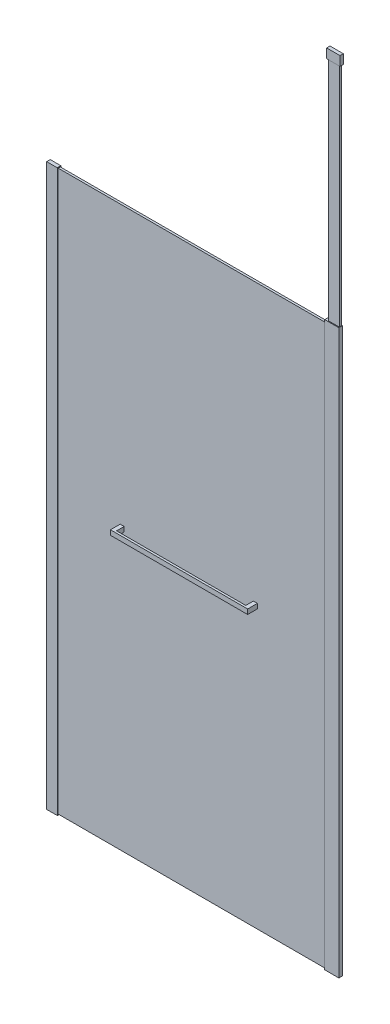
from build123d import *

# Parameters (mm, degrees)
DODANIE_WYCI_GNI_CIE1_START         = 3
DODANIE_WYCI_GNI_CIE1_DEPTH         = 2100
SZKIC2_W                            = 1047
SZKIC2_H                            = 8
DODANIE_WYCI_GNI_CIE2_DEPTH         = 2100
DODANIE_WYCI_GNI_CIE3_DEPTH         = 2108
SZKIC4_W                            = 40
SZKIC4_H                            = 13.3
DODANIE_WYCI_GNI_CIE4_DEPTH         = 3
SZKIC5_W                            = 53
SZKIC5_H                            = 14
DODANIE_WYCI_GNI_CIE5_DEPTH         = 3
SZKIC6_W                            = 8.1
SZKIC6_H                            = 7.8
DODANIE_WYCI_GNI_CIE6_DEPTH         = 15
SZKIC7_W                            = 53
SZKIC7_H                            = 14
DODANIE_WYCI_GNI_CIE7_DEPTH         = 3
SZKIC8_W                            = 40
SZKIC8_H                            = 13.3
DODANIE_WYCI_GNI_CIE8_DEPTH         = 3
SZKIC9_W                            = 40
SZKIC9_H                            = 8
DODANIE_WYCI_GNI_CIE9_DEPTH         = 883
DODANIE_WYCI_GNI_CIE10_START        = -32
SZKIC10_W                           = 50
SZKIC10_H                           = 12.5
DODANIE_WYCI_GNI_CIE10_DEPTH        = 35
DODANIE_WYCI_GNI_CIE11_DEPTH        = 36.5
DODANIE_WYCI_GNI_CIE11_DEPTH_BACK   = 18
SZKIC12_W                           = 15
SZKIC12_H                           = 18
DODANIE_WYCI_GNI_CIE11_2_DEPTH      = 36.5
DODANIE_WYCI_GNI_CIE11_2_DEPTH_BACK = 18
SZKIC13_W                           = 8
SZKIC13_H                           = 18
DODANIE_WYCI_GNI_CIE12_DEPTH        = 485


with BuildPart() as part:
    # Szkic1 → Dodanie-wyci_gni_cie1 (new body)
    with BuildSketch(Plane(origin=(0, 0, 0), x_dir=(1, 0, 0), z_dir=(0, 1, 0)).offset(DODANIE_WYCI_GNI_CIE1_START)):
        Polygon((0, 0), (0, 13.3), (40, 13.3), (40, 11.4), (6.5, 11.4), (6.5, 3.4), (40, 3.4), (40, 0), align=None)
    extrude(amount=DODANIE_WYCI_GNI_CIE1_DEPTH)

    # Szkic4 → Dodanie-wyci_gni_cie4 (add)
    with BuildSketch(Plane(origin=(0, 2103, 0), x_dir=(1, 0, 0), z_dir=(0, 1, 0))):
        with Locations((20, 6.65)):
            Rectangle(SZKIC4_W, SZKIC4_H)
    extrude(amount=DODANIE_WYCI_GNI_CIE4_DEPTH)

    # Szkic8 → Dodanie-wyci_gni_cie8 (add)
    with BuildSketch(Plane.XZ.offset(-3)):
        with Locations((20, -6.65)):
            Rectangle(SZKIC8_W, SZKIC8_H)
    extrude(amount=DODANIE_WYCI_GNI_CIE8_DEPTH)


with BuildPart() as body_2:
    # Szkic2 → Dodanie-wyci_gni_cie2 (new body)
    with BuildSketch(Plane.XZ.offset(-3)):
        with Locations((530, -7.4)):
            Rectangle(SZKIC2_W, SZKIC2_H)
    extrude(amount=-DODANIE_WYCI_GNI_CIE2_DEPTH)


with BuildPart() as body_3:
    # Szkic3 → Dodanie-wyci_gni_cie3 (new body)
    with BuildSketch(Plane.XZ.offset(-3)):
        Polygon((1043.4, -3.4), (1043.4, -0.4), (1096.4, -0.4), (1096.4, -14.4), (1043.4, -14.4), (1043.4, -11.4), (1053.5, -11.4), (1053.5, -3.4), align=None)
    extrude(amount=-DODANIE_WYCI_GNI_CIE3_DEPTH)

    # Szkic5 → Dodanie-wyci_gni_cie5 (add)
    with BuildSketch(Plane(origin=(0, 2111, 0), x_dir=(1, 0, 0), z_dir=(0, 1, 0))):
        with Locations((1069.9, 7.4)):
            Rectangle(SZKIC5_W, SZKIC5_H)
    extrude(amount=DODANIE_WYCI_GNI_CIE5_DEPTH)

    # Szkic6 → Dodanie-wyci_gni_cie6 (add)
    with BuildSketch(Plane.ZY.offset(-1043.4)):
        with Locations((-7.4, 2107.1)):
            Rectangle(SZKIC6_W, SZKIC6_H)
    extrude(amount=-DODANIE_WYCI_GNI_CIE6_DEPTH)

    # Szkic7 → Dodanie-wyci_gni_cie7 (add)
    with BuildSketch(Plane.XZ.offset(-3)):
        with Locations((1069.9, -7.4)):
            Rectangle(SZKIC7_W, SZKIC7_H)
    extrude(amount=DODANIE_WYCI_GNI_CIE7_DEPTH)


with BuildPart() as body_4:
    # Szkic9 → Dodanie-wyci_gni_cie9 (new body)
    with BuildSketch(Plane(origin=(0, 2114, 2099.6), x_dir=(-1, 0, 0), z_dir=(0, -1, 0))):
        with Locations((-1074.9, 2107)):
            Rectangle(SZKIC9_W, SZKIC9_H)
    extrude(amount=-DODANIE_WYCI_GNI_CIE9_DEPTH)

    # Szkic10 → Dodanie-wyci_gni_cie10 (add)
    with BuildSketch(Plane(origin=(0, 2997, 0), x_dir=(-1, 0, 0), z_dir=(0, 1, 0)).offset(DODANIE_WYCI_GNI_CIE10_START)):
        with Locations((-1074.9, -7.4)):
            Rectangle(SZKIC10_W, SZKIC10_H)
    extrude(amount=DODANIE_WYCI_GNI_CIE10_DEPTH)


with BuildPart() as body_5:
    # Szkic12 → Dodanie-wyci_gni_cie11 (new, two sides: drawn at the far end of the back side and taken through both)
    with BuildSketch(Plane.XY.offset(-3.4).offset(-DODANIE_WYCI_GNI_CIE11_DEPTH_BACK)):
        with Locations((280, 1053)):
            Rectangle(SZKIC12_W, SZKIC12_H)
    extrude(amount=DODANIE_WYCI_GNI_CIE11_DEPTH + DODANIE_WYCI_GNI_CIE11_DEPTH_BACK)



with BuildPart() as body_6:
    # Szkic12 → Dodanie-wyci_gni_cie11 2 (new, two sides: drawn at the far end of the back side and taken through both)
    with BuildSketch(Plane.XY.offset(-3.4).offset(-DODANIE_WYCI_GNI_CIE11_2_DEPTH_BACK)):
        with Locations((780, 1053)):
            Rectangle(SZKIC12_W, SZKIC12_H)
    extrude(amount=DODANIE_WYCI_GNI_CIE11_2_DEPTH + DODANIE_WYCI_GNI_CIE11_2_DEPTH_BACK)


with BuildPart() as body_5_1:
    add(body_5.part)

    add(body_6.part)  # Dodanie-wyci_gni_cie12 merges body 6
    # Szkic13 → Dodanie-wyci_gni_cie12 (add)
    with BuildSketch(Plane(origin=(287.5, 0, 0), x_dir=(0, 0, -1), z_dir=(1, 0, 0))):
        with Locations((-29.1, 1053)):
            Rectangle(SZKIC13_W, SZKIC13_H)
    extrude(amount=DODANIE_WYCI_GNI_CIE12_DEPTH)


solid = Compound([part.part, body_2.part, body_3.part, body_4.part, body_5_1.part])
